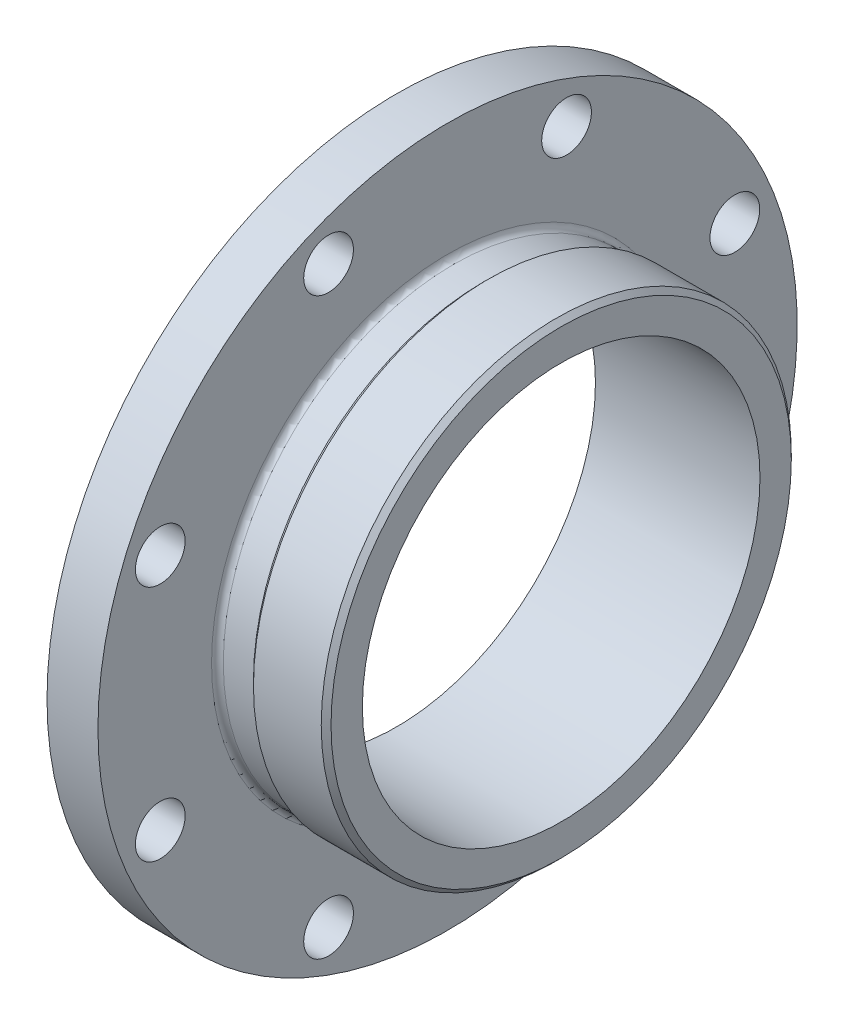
ISO-10303-21;
HEADER;
FILE_DESCRIPTION(('STEP AP214'),'2;1');
FILE_NAME('part.step','',(''),(''),'','','');
FILE_SCHEMA(('AUTOMOTIVE_DESIGN { 1 0 10303 214 1 1 1 1 }'));
ENDSEC;
DATA;
#1=APPLICATION_CONTEXT('core data for automotive mechanical design processes');
#2=APPLICATION_PROTOCOL_DEFINITION('international standard','automotive_design',2000,#1);
#3=PRODUCT_CONTEXT('',#1,'mechanical');
#4=PRODUCT('Part','Part','',(#3));
#5=PRODUCT_RELATED_PRODUCT_CATEGORY('part','',(#4));
#6=PRODUCT_DEFINITION_FORMATION('','',#4);
#7=PRODUCT_DEFINITION_CONTEXT('part definition',#1,'design');
#8=PRODUCT_DEFINITION('design','',#6,#7);
#9=PRODUCT_DEFINITION_SHAPE('','',#8);
#10=(LENGTH_UNIT() NAMED_UNIT(*) SI_UNIT(.MILLI.,.METRE.));
#11=(NAMED_UNIT(*) PLANE_ANGLE_UNIT() SI_UNIT($,.RADIAN.));
#12=(NAMED_UNIT(*) SI_UNIT($,.STERADIAN.) SOLID_ANGLE_UNIT());
#13=UNCERTAINTY_MEASURE_WITH_UNIT(LENGTH_MEASURE(1.E-05),#10,'distance_accuracy_value','');
#14=(GEOMETRIC_REPRESENTATION_CONTEXT(3) GLOBAL_UNCERTAINTY_ASSIGNED_CONTEXT((#13)) GLOBAL_UNIT_ASSIGNED_CONTEXT((#10,
#11,#12)) REPRESENTATION_CONTEXT('',''));
#15=CARTESIAN_POINT('',(0.,0.,0.));
#16=DIRECTION('',(0.,0.,1.));
#17=DIRECTION('',(1.,0.,0.));
#18=AXIS2_PLACEMENT_3D('',#15,#16,#17);
#19=CARTESIAN_POINT('',(0.,101.5,0.));
#20=DIRECTION('',(1.,0.,0.));
#21=DIRECTION('',(0.,0.,-1.));
#22=AXIS2_PLACEMENT_3D('',#19,#20,#21);
#23=PLANE('',#22);
#24=CARTESIAN_POINT('',(0.,146.665875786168,-60.7509948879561));
#25=DIRECTION('',(-1.,0.,0.));
#26=DIRECTION('',(0.,0.707106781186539,0.707106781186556));
#27=AXIS2_PLACEMENT_3D('',#24,#25,#26);
#28=CIRCLE('',#27,12.7);
#29=CARTESIAN_POINT('',(0.,146.665875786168,-48.0509948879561));
#30=VERTEX_POINT('',#29);
#31=EDGE_CURVE('E430',#30,#30,#28,.T.);
#32=ORIENTED_EDGE('',*,*,#31,.F.);
#33=EDGE_LOOP('',(#32));
#34=FACE_BOUND('',#33,.T.);
#35=CARTESIAN_POINT('',(0.,60.7509948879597,-146.665875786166));
#36=DIRECTION('',(-1.,0.,0.));
#37=DIRECTION('',(0.,1.,0.));
#38=AXIS2_PLACEMENT_3D('',#35,#36,#37);
#39=CIRCLE('',#38,12.7);
#40=CARTESIAN_POINT('',(0.,60.7509948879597,-133.965875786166));
#41=VERTEX_POINT('',#40);
#42=EDGE_CURVE('E420',#41,#41,#39,.T.);
#43=ORIENTED_EDGE('',*,*,#42,.F.);
#44=EDGE_LOOP('',(#43));
#45=FACE_BOUND('',#44,.T.);
#46=CARTESIAN_POINT('',(0.,-60.7509948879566,-146.665875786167));
#47=DIRECTION('',(-1.,0.,0.));
#48=DIRECTION('',(0.,0.707106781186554,-0.707106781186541));
#49=AXIS2_PLACEMENT_3D('',#46,#47,#48);
#50=CIRCLE('',#49,12.7);
#51=CARTESIAN_POINT('',(0.,-60.7509948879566,-133.965875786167));
#52=VERTEX_POINT('',#51);
#53=EDGE_CURVE('E417',#52,#52,#50,.T.);
#54=ORIENTED_EDGE('',*,*,#53,.F.);
#55=EDGE_LOOP('',(#54));
#56=FACE_BOUND('',#55,.T.);
#57=CARTESIAN_POINT('',(0.,-146.665875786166,-60.7509948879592));
#58=DIRECTION('',(-1.,0.,0.));
#59=DIRECTION('',(0.,0.,-1.));
#60=AXIS2_PLACEMENT_3D('',#57,#58,#59);
#61=CIRCLE('',#60,12.7);
#62=CARTESIAN_POINT('',(0.,-146.665875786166,-48.0509948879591));
#63=VERTEX_POINT('',#62);
#64=EDGE_CURVE('E414',#63,#63,#61,.T.);
#65=ORIENTED_EDGE('',*,*,#64,.F.);
#66=EDGE_LOOP('',(#65));
#67=FACE_BOUND('',#66,.T.);
#68=CARTESIAN_POINT('',(0.,-146.665875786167,60.7509948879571));
#69=DIRECTION('',(-1.,0.,0.));
#70=DIRECTION('',(0.,-0.707106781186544,-0.707106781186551));
#71=AXIS2_PLACEMENT_3D('',#68,#69,#70);
#72=CIRCLE('',#71,12.7);
#73=CARTESIAN_POINT('',(0.,-146.665875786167,73.4509948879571));
#74=VERTEX_POINT('',#73);
#75=EDGE_CURVE('E410',#74,#74,#72,.T.);
#76=ORIENTED_EDGE('',*,*,#75,.F.);
#77=EDGE_LOOP('',(#76));
#78=FACE_BOUND('',#77,.T.);
#79=CARTESIAN_POINT('',(0.,-60.7509948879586,146.665875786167));
#80=DIRECTION('',(-1.,0.,0.));
#81=DIRECTION('',(0.,-1.,0.));
#82=AXIS2_PLACEMENT_3D('',#79,#80,#81);
#83=CIRCLE('',#82,12.7);
#84=CARTESIAN_POINT('',(0.,-60.7509948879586,159.365875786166));
#85=VERTEX_POINT('',#84);
#86=EDGE_CURVE('E406',#85,#85,#83,.T.);
#87=ORIENTED_EDGE('',*,*,#86,.F.);
#88=EDGE_LOOP('',(#87));
#89=FACE_BOUND('',#88,.T.);
#90=CARTESIAN_POINT('',(0.,60.7509948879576,146.665875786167));
#91=DIRECTION('',(-1.,0.,0.));
#92=DIRECTION('',(0.,-0.707106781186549,0.707106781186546));
#93=AXIS2_PLACEMENT_3D('',#90,#91,#92);
#94=CIRCLE('',#93,12.7);
#95=CARTESIAN_POINT('',(0.,60.7509948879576,159.365875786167));
#96=VERTEX_POINT('',#95);
#97=EDGE_CURVE('E402',#96,#96,#94,.T.);
#98=ORIENTED_EDGE('',*,*,#97,.F.);
#99=EDGE_LOOP('',(#98));
#100=FACE_BOUND('',#99,.T.);
#101=CARTESIAN_POINT('',(0.,146.665875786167,60.7509948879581));
#102=DIRECTION('',(-1.,0.,0.));
#103=DIRECTION('',(0.,0.,1.));
#104=AXIS2_PLACEMENT_3D('',#101,#102,#103);
#105=CIRCLE('',#104,12.7);
#106=CARTESIAN_POINT('',(0.,146.665875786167,73.4509948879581));
#107=VERTEX_POINT('',#106);
#108=EDGE_CURVE('E398',#107,#107,#105,.T.);
#109=ORIENTED_EDGE('',*,*,#108,.F.);
#110=EDGE_LOOP('',(#109));
#111=FACE_BOUND('',#110,.T.);
#112=CARTESIAN_POINT('',(0.,0.,0.));
#113=DIRECTION('',(-1.,0.,0.));
#114=DIRECTION('',(0.,0.,1.));
#115=AXIS2_PLACEMENT_3D('',#112,#113,#114);
#116=CIRCLE('',#115,101.5);
#117=CARTESIAN_POINT('',(0.,0.,101.5));
#118=VERTEX_POINT('',#117);
#119=EDGE_CURVE('E397',#118,#118,#116,.T.);
#120=ORIENTED_EDGE('',*,*,#119,.F.);
#121=EDGE_LOOP('',(#120));
#122=FACE_BOUND('',#121,.T.);
#123=CARTESIAN_POINT('',(0.,0.,0.));
#124=DIRECTION('',(-1.,0.,0.));
#125=DIRECTION('',(0.,0.,1.));
#126=AXIS2_PLACEMENT_3D('',#123,#124,#125);
#127=CIRCLE('',#126,178.5);
#128=CARTESIAN_POINT('',(0.,0.,178.5));
#129=VERTEX_POINT('',#128);
#130=EDGE_CURVE('E390',#129,#129,#127,.T.);
#131=ORIENTED_EDGE('',*,*,#130,.T.);
#132=EDGE_LOOP('',(#131));
#133=FACE_BOUND('',#132,.T.);
#134=ADVANCED_FACE('F378',(#34,#45,#56,#67,#78,#89,#100,#111,#122,#133),#23,.F.);
#135=CARTESIAN_POINT('',(0.,0.,0.));
#136=DIRECTION('',(-1.,0.,0.));
#137=DIRECTION('',(0.,0.,1.));
#138=AXIS2_PLACEMENT_3D('',#135,#136,#137);
#139=CYLINDRICAL_SURFACE('',#138,178.5);
#140=ORIENTED_EDGE('',*,*,#130,.F.);
#141=EDGE_LOOP('',(#140));
#142=FACE_BOUND('',#141,.T.);
#143=CARTESIAN_POINT('',(26.,0.,0.));
#144=DIRECTION('',(-1.,0.,0.));
#145=DIRECTION('',(0.,0.,1.));
#146=AXIS2_PLACEMENT_3D('',#143,#144,#145);
#147=CIRCLE('',#146,178.5);
#148=CARTESIAN_POINT('',(26.,0.,178.5));
#149=VERTEX_POINT('',#148);
#150=EDGE_CURVE('E460',#149,#149,#147,.T.);
#151=ORIENTED_EDGE('',*,*,#150,.T.);
#152=EDGE_LOOP('',(#151));
#153=FACE_BOUND('',#152,.T.);
#154=ADVANCED_FACE('F466',(#142,#153),#139,.T.);
#155=CARTESIAN_POINT('',(26.,178.5,0.));
#156=DIRECTION('',(-1.,0.,0.));
#157=DIRECTION('',(0.,0.,1.));
#158=AXIS2_PLACEMENT_3D('',#155,#156,#157);
#159=PLANE('',#158);
#160=CARTESIAN_POINT('',(26.,146.665875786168,-60.7509948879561));
#161=DIRECTION('',(-1.,0.,0.));
#162=DIRECTION('',(0.,0.,1.));
#163=AXIS2_PLACEMENT_3D('',#160,#161,#162);
#164=CIRCLE('',#163,12.7);
#165=CARTESIAN_POINT('',(26.,146.665875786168,-48.0509948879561));
#166=VERTEX_POINT('',#165);
#167=EDGE_CURVE('E381',#166,#166,#164,.T.);
#168=ORIENTED_EDGE('',*,*,#167,.T.);
#169=EDGE_LOOP('',(#168));
#170=FACE_BOUND('',#169,.T.);
#171=CARTESIAN_POINT('',(26.,60.7509948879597,-146.665875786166));
#172=DIRECTION('',(-1.,0.,0.));
#173=DIRECTION('',(0.,0.,1.));
#174=AXIS2_PLACEMENT_3D('',#171,#172,#173);
#175=CIRCLE('',#174,12.7);
#176=CARTESIAN_POINT('',(26.,60.7509948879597,-133.965875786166));
#177=VERTEX_POINT('',#176);
#178=EDGE_CURVE('E418',#177,#177,#175,.T.);
#179=ORIENTED_EDGE('',*,*,#178,.T.);
#180=EDGE_LOOP('',(#179));
#181=FACE_BOUND('',#180,.T.);
#182=CARTESIAN_POINT('',(26.,-60.7509948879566,-146.665875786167));
#183=DIRECTION('',(-1.,0.,0.));
#184=DIRECTION('',(0.,0.,1.));
#185=AXIS2_PLACEMENT_3D('',#182,#183,#184);
#186=CIRCLE('',#185,12.7);
#187=CARTESIAN_POINT('',(26.,-60.7509948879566,-133.965875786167));
#188=VERTEX_POINT('',#187);
#189=EDGE_CURVE('E415',#188,#188,#186,.T.);
#190=ORIENTED_EDGE('',*,*,#189,.T.);
#191=EDGE_LOOP('',(#190));
#192=FACE_BOUND('',#191,.T.);
#193=CARTESIAN_POINT('',(26.,-146.665875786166,-60.7509948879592));
#194=DIRECTION('',(-1.,0.,0.));
#195=DIRECTION('',(0.,0.,1.));
#196=AXIS2_PLACEMENT_3D('',#193,#194,#195);
#197=CIRCLE('',#196,12.7);
#198=CARTESIAN_POINT('',(26.,-146.665875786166,-48.0509948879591));
#199=VERTEX_POINT('',#198);
#200=EDGE_CURVE('E411',#199,#199,#197,.T.);
#201=ORIENTED_EDGE('',*,*,#200,.T.);
#202=EDGE_LOOP('',(#201));
#203=FACE_BOUND('',#202,.T.);
#204=CARTESIAN_POINT('',(26.,-146.665875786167,60.7509948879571));
#205=DIRECTION('',(-1.,0.,0.));
#206=DIRECTION('',(0.,0.,1.));
#207=AXIS2_PLACEMENT_3D('',#204,#205,#206);
#208=CIRCLE('',#207,12.7);
#209=CARTESIAN_POINT('',(26.,-146.665875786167,73.4509948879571));
#210=VERTEX_POINT('',#209);
#211=EDGE_CURVE('E407',#210,#210,#208,.T.);
#212=ORIENTED_EDGE('',*,*,#211,.T.);
#213=EDGE_LOOP('',(#212));
#214=FACE_BOUND('',#213,.T.);
#215=CARTESIAN_POINT('',(26.,-60.7509948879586,146.665875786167));
#216=DIRECTION('',(-1.,0.,0.));
#217=DIRECTION('',(0.,0.,1.));
#218=AXIS2_PLACEMENT_3D('',#215,#216,#217);
#219=CIRCLE('',#218,12.7);
#220=CARTESIAN_POINT('',(26.,-60.7509948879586,159.365875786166));
#221=VERTEX_POINT('',#220);
#222=EDGE_CURVE('E403',#221,#221,#219,.T.);
#223=ORIENTED_EDGE('',*,*,#222,.T.);
#224=EDGE_LOOP('',(#223));
#225=FACE_BOUND('',#224,.T.);
#226=CARTESIAN_POINT('',(26.,60.7509948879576,146.665875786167));
#227=DIRECTION('',(-1.,0.,0.));
#228=DIRECTION('',(0.,0.,1.));
#229=AXIS2_PLACEMENT_3D('',#226,#227,#228);
#230=CIRCLE('',#229,12.7);
#231=CARTESIAN_POINT('',(26.,60.7509948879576,159.365875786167));
#232=VERTEX_POINT('',#231);
#233=EDGE_CURVE('E399',#232,#232,#230,.T.);
#234=ORIENTED_EDGE('',*,*,#233,.T.);
#235=EDGE_LOOP('',(#234));
#236=FACE_BOUND('',#235,.T.);
#237=CARTESIAN_POINT('',(26.,146.665875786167,60.7509948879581));
#238=DIRECTION('',(-1.,0.,0.));
#239=DIRECTION('',(0.,0.,1.));
#240=AXIS2_PLACEMENT_3D('',#237,#238,#239);
#241=CIRCLE('',#240,12.7);
#242=CARTESIAN_POINT('',(26.,146.665875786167,73.4509948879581));
#243=VERTEX_POINT('',#242);
#244=EDGE_CURVE('E394',#243,#243,#241,.T.);
#245=ORIENTED_EDGE('',*,*,#244,.T.);
#246=EDGE_LOOP('',(#245));
#247=FACE_BOUND('',#246,.T.);
#248=CARTESIAN_POINT('',(26.,0.,0.));
#249=DIRECTION('',(-1.,0.,0.));
#250=DIRECTION('',(0.,0.,1.));
#251=AXIS2_PLACEMENT_3D('',#248,#249,#250);
#252=CIRCLE('',#251,120.5);
#253=CARTESIAN_POINT('',(26.,0.,120.5));
#254=VERTEX_POINT('',#253);
#255=EDGE_CURVE('E385',#254,#254,#252,.T.);
#256=ORIENTED_EDGE('',*,*,#255,.T.);
#257=EDGE_LOOP('',(#256));
#258=FACE_BOUND('',#257,.T.);
#259=ORIENTED_EDGE('',*,*,#150,.F.);
#260=EDGE_LOOP('',(#259));
#261=FACE_BOUND('',#260,.T.);
#262=ADVANCED_FACE('F469',(#170,#181,#192,#203,#214,#225,#236,#247,#258,#261),#159,.F.);
#263=CARTESIAN_POINT('',(0.,0.,0.));
#264=DIRECTION('',(-1.,0.,0.));
#265=DIRECTION('',(0.,0.,1.));
#266=AXIS2_PLACEMENT_3D('',#263,#264,#265);
#267=CYLINDRICAL_SURFACE('',#266,117.5);
#268=CARTESIAN_POINT('',(29.,0.,0.));
#269=DIRECTION('',(-1.,0.,0.));
#270=DIRECTION('',(0.,0.,1.));
#271=AXIS2_PLACEMENT_3D('',#268,#269,#270);
#272=CIRCLE('',#271,117.5);
#273=CARTESIAN_POINT('',(29.,0.,117.5));
#274=VERTEX_POINT('',#273);
#275=EDGE_CURVE('E10',#274,#274,#272,.F.);
#276=ORIENTED_EDGE('',*,*,#275,.T.);
#277=EDGE_LOOP('',(#276));
#278=FACE_BOUND('',#277,.T.);
#279=CARTESIAN_POINT('',(44.4,0.,0.));
#280=DIRECTION('',(-1.,0.,0.));
#281=DIRECTION('',(0.,0.,1.));
#282=AXIS2_PLACEMENT_3D('',#279,#280,#281);
#283=CIRCLE('',#282,117.5);
#284=CARTESIAN_POINT('',(44.4,0.,117.5));
#285=VERTEX_POINT('',#284);
#286=EDGE_CURVE('E457',#285,#285,#283,.T.);
#287=ORIENTED_EDGE('',*,*,#286,.T.);
#288=EDGE_LOOP('',(#287));
#289=FACE_BOUND('',#288,.T.);
#290=ADVANCED_FACE('F473',(#278,#289),#267,.T.);
#291=CARTESIAN_POINT('',(46.9,0.,0.));
#292=DIRECTION('',(1.,0.,0.));
#293=DIRECTION('',(0.,0.,-1.));
#294=AXIS2_PLACEMENT_3D('',#291,#292,#293);
#295=CONICAL_SURFACE('',#294,120.,0.785398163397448);
#296=ORIENTED_EDGE('',*,*,#286,.F.);
#297=EDGE_LOOP('',(#296));
#298=FACE_BOUND('',#297,.T.);
#299=CARTESIAN_POINT('',(46.9,0.,0.));
#300=DIRECTION('',(-1.,0.,0.));
#301=DIRECTION('',(0.,0.,1.));
#302=AXIS2_PLACEMENT_3D('',#299,#300,#301);
#303=CIRCLE('',#302,120.);
#304=CARTESIAN_POINT('',(46.9,0.,120.));
#305=VERTEX_POINT('',#304);
#306=EDGE_CURVE('E454',#305,#305,#303,.T.);
#307=ORIENTED_EDGE('',*,*,#306,.T.);
#308=EDGE_LOOP('',(#307));
#309=FACE_BOUND('',#308,.T.);
#310=ADVANCED_FACE('F481',(#298,#309),#295,.T.);
#311=CARTESIAN_POINT('',(0.,0.,0.));
#312=DIRECTION('',(-1.,0.,0.));
#313=DIRECTION('',(0.,0.,1.));
#314=AXIS2_PLACEMENT_3D('',#311,#312,#313);
#315=CYLINDRICAL_SURFACE('',#314,120.);
#316=ORIENTED_EDGE('',*,*,#306,.F.);
#317=EDGE_LOOP('',(#316));
#318=FACE_BOUND('',#317,.T.);
#319=CARTESIAN_POINT('',(81.5,0.,0.));
#320=DIRECTION('',(-1.,0.,0.));
#321=DIRECTION('',(0.,0.,1.));
#322=AXIS2_PLACEMENT_3D('',#319,#320,#321);
#323=CIRCLE('',#322,120.);
#324=CARTESIAN_POINT('',(81.5,0.,120.));
#325=VERTEX_POINT('',#324);
#326=EDGE_CURVE('E451',#325,#325,#323,.T.);
#327=ORIENTED_EDGE('',*,*,#326,.T.);
#328=EDGE_LOOP('',(#327));
#329=FACE_BOUND('',#328,.T.);
#330=ADVANCED_FACE('F526',(#318,#329),#315,.T.);
#331=CARTESIAN_POINT('',(84.,0.,0.));
#332=DIRECTION('',(-1.,0.,0.));
#333=DIRECTION('',(0.,0.,1.));
#334=AXIS2_PLACEMENT_3D('',#331,#332,#333);
#335=CONICAL_SURFACE('',#334,117.5,0.785398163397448);
#336=ORIENTED_EDGE('',*,*,#326,.F.);
#337=EDGE_LOOP('',(#336));
#338=FACE_BOUND('',#337,.T.);
#339=CARTESIAN_POINT('',(84.,0.,0.));
#340=DIRECTION('',(-1.,0.,0.));
#341=DIRECTION('',(0.,0.,1.));
#342=AXIS2_PLACEMENT_3D('',#339,#340,#341);
#343=CIRCLE('',#342,117.5);
#344=CARTESIAN_POINT('',(84.,0.,117.5));
#345=VERTEX_POINT('',#344);
#346=EDGE_CURVE('E448',#345,#345,#343,.T.);
#347=ORIENTED_EDGE('',*,*,#346,.T.);
#348=EDGE_LOOP('',(#347));
#349=FACE_BOUND('',#348,.T.);
#350=ADVANCED_FACE('F518',(#338,#349),#335,.T.);
#351=CARTESIAN_POINT('',(84.,101.5,0.));
#352=DIRECTION('',(-1.,0.,0.));
#353=DIRECTION('',(0.,0.,1.));
#354=AXIS2_PLACEMENT_3D('',#351,#352,#353);
#355=PLANE('',#354);
#356=ORIENTED_EDGE('',*,*,#346,.F.);
#357=EDGE_LOOP('',(#356));
#358=FACE_BOUND('',#357,.T.);
#359=CARTESIAN_POINT('',(84.,0.,0.));
#360=DIRECTION('',(-1.,0.,0.));
#361=DIRECTION('',(0.,0.,1.));
#362=AXIS2_PLACEMENT_3D('',#359,#360,#361);
#363=CIRCLE('',#362,101.5);
#364=CARTESIAN_POINT('',(84.,0.,101.5));
#365=VERTEX_POINT('',#364);
#366=EDGE_CURVE('E445',#365,#365,#363,.T.);
#367=ORIENTED_EDGE('',*,*,#366,.T.);
#368=EDGE_LOOP('',(#367));
#369=FACE_BOUND('',#368,.T.);
#370=ADVANCED_FACE('F508',(#358,#369),#355,.F.);
#371=CARTESIAN_POINT('',(0.,0.,0.));
#372=DIRECTION('',(-1.,0.,0.));
#373=DIRECTION('',(0.,0.,1.));
#374=AXIS2_PLACEMENT_3D('',#371,#372,#373);
#375=CYLINDRICAL_SURFACE('',#374,101.5);
#376=ORIENTED_EDGE('',*,*,#366,.F.);
#377=EDGE_LOOP('',(#376));
#378=FACE_BOUND('',#377,.T.);
#379=ORIENTED_EDGE('',*,*,#119,.T.);
#380=EDGE_LOOP('',(#379));
#381=FACE_BOUND('',#380,.T.);
#382=ADVANCED_FACE('F505',(#378,#381),#375,.F.);
#383=CARTESIAN_POINT('',(29.,0.,0.));
#384=DIRECTION('',(-1.,0.,0.));
#385=DIRECTION('',(0.,0.,1.));
#386=AXIS2_PLACEMENT_3D('',#383,#384,#385);
#387=TOROIDAL_SURFACE('',#386,120.5,3.);
#388=ORIENTED_EDGE('',*,*,#275,.F.);
#389=EDGE_LOOP('',(#388));
#390=FACE_BOUND('',#389,.T.);
#391=ORIENTED_EDGE('',*,*,#255,.F.);
#392=EDGE_LOOP('',(#391));
#393=FACE_BOUND('',#392,.T.);
#394=ADVANCED_FACE('F507',(#390,#393),#387,.F.);
#395=CARTESIAN_POINT('',(84.,146.665875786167,60.7509948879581));
#396=DIRECTION('',(-1.,0.,0.));
#397=DIRECTION('',(0.,0.,1.));
#398=AXIS2_PLACEMENT_3D('',#395,#396,#397);
#399=CYLINDRICAL_SURFACE('',#398,12.7);
#400=CARTESIAN_POINT('',(0.,146.665875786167,73.4509948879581));
#401=CARTESIAN_POINT('',(0.270833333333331,146.665875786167,73.4509948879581));
#402=CARTESIAN_POINT('',(0.541666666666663,146.665875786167,73.4509948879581));
#403=CARTESIAN_POINT('',(1.08333333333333,146.665875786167,73.4509948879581));
#404=CARTESIAN_POINT('',(1.35416666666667,146.665875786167,73.4509948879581));
#405=CARTESIAN_POINT('',(1.89583333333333,146.665875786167,73.4509948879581));
#406=CARTESIAN_POINT('',(2.16666666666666,146.665875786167,73.4509948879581));
#407=CARTESIAN_POINT('',(2.70833333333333,146.665875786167,73.4509948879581));
#408=CARTESIAN_POINT('',(2.97916666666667,146.665875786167,73.4509948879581));
#409=CARTESIAN_POINT('',(3.52083333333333,146.665875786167,73.4509948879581));
#410=CARTESIAN_POINT('',(3.79166666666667,146.665875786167,73.4509948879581));
#411=CARTESIAN_POINT('',(4.33333333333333,146.665875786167,73.4509948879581));
#412=CARTESIAN_POINT('',(4.60416666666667,146.665875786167,73.4509948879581));
#413=CARTESIAN_POINT('',(5.14583333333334,146.665875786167,73.4509948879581));
#414=CARTESIAN_POINT('',(5.41666666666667,146.665875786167,73.4509948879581));
#415=CARTESIAN_POINT('',(5.95833333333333,146.665875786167,73.4509948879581));
#416=CARTESIAN_POINT('',(6.22916666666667,146.665875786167,73.4509948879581));
#417=CARTESIAN_POINT('',(6.77083333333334,146.665875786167,73.4509948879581));
#418=CARTESIAN_POINT('',(7.04166666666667,146.665875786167,73.4509948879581));
#419=CARTESIAN_POINT('',(7.58333333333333,146.665875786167,73.4509948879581));
#420=CARTESIAN_POINT('',(7.85416666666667,146.665875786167,73.4509948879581));
#421=CARTESIAN_POINT('',(8.39583333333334,146.665875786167,73.4509948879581));
#422=CARTESIAN_POINT('',(8.66666666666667,146.665875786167,73.4509948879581));
#423=CARTESIAN_POINT('',(9.20833333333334,146.665875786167,73.4509948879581));
#424=CARTESIAN_POINT('',(9.47916666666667,146.665875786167,73.4509948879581));
#425=CARTESIAN_POINT('',(10.0208333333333,146.665875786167,73.4509948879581));
#426=CARTESIAN_POINT('',(10.2916666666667,146.665875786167,73.4509948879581));
#427=CARTESIAN_POINT('',(10.8333333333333,146.665875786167,73.4509948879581));
#428=CARTESIAN_POINT('',(11.1041666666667,146.665875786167,73.4509948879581));
#429=CARTESIAN_POINT('',(11.6458333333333,146.665875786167,73.4509948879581));
#430=CARTESIAN_POINT('',(11.9166666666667,146.665875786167,73.4509948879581));
#431=CARTESIAN_POINT('',(12.4583333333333,146.665875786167,73.4509948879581));
#432=CARTESIAN_POINT('',(12.7291666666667,146.665875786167,73.4509948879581));
#433=CARTESIAN_POINT('',(13.2708333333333,146.665875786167,73.4509948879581));
#434=CARTESIAN_POINT('',(13.5416666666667,146.665875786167,73.4509948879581));
#435=CARTESIAN_POINT('',(14.0833333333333,146.665875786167,73.4509948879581));
#436=CARTESIAN_POINT('',(14.3541666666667,146.665875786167,73.4509948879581));
#437=CARTESIAN_POINT('',(14.8958333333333,146.665875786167,73.4509948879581));
#438=CARTESIAN_POINT('',(15.1666666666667,146.665875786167,73.4509948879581));
#439=CARTESIAN_POINT('',(15.7083333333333,146.665875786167,73.4509948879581));
#440=CARTESIAN_POINT('',(15.9791666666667,146.665875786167,73.4509948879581));
#441=CARTESIAN_POINT('',(16.5208333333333,146.665875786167,73.4509948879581));
#442=CARTESIAN_POINT('',(16.7916666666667,146.665875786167,73.4509948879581));
#443=CARTESIAN_POINT('',(17.3333333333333,146.665875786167,73.4509948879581));
#444=CARTESIAN_POINT('',(17.6041666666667,146.665875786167,73.4509948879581));
#445=CARTESIAN_POINT('',(18.1458333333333,146.665875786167,73.4509948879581));
#446=CARTESIAN_POINT('',(18.4166666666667,146.665875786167,73.4509948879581));
#447=CARTESIAN_POINT('',(18.9583333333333,146.665875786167,73.4509948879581));
#448=CARTESIAN_POINT('',(19.2291666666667,146.665875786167,73.4509948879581));
#449=CARTESIAN_POINT('',(19.7708333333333,146.665875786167,73.4509948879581));
#450=CARTESIAN_POINT('',(20.0416666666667,146.665875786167,73.4509948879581));
#451=CARTESIAN_POINT('',(20.5833333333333,146.665875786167,73.4509948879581));
#452=CARTESIAN_POINT('',(20.8541666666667,146.665875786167,73.4509948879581));
#453=CARTESIAN_POINT('',(21.3958333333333,146.665875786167,73.4509948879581));
#454=CARTESIAN_POINT('',(21.6666666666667,146.665875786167,73.4509948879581));
#455=CARTESIAN_POINT('',(22.2083333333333,146.665875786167,73.4509948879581));
#456=CARTESIAN_POINT('',(22.4791666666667,146.665875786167,73.4509948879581));
#457=CARTESIAN_POINT('',(23.0208333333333,146.665875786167,73.4509948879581));
#458=CARTESIAN_POINT('',(23.2916666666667,146.665875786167,73.4509948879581));
#459=CARTESIAN_POINT('',(23.8333333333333,146.665875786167,73.4509948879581));
#460=CARTESIAN_POINT('',(24.1041666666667,146.665875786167,73.4509948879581));
#461=CARTESIAN_POINT('',(24.6458333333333,146.665875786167,73.4509948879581));
#462=CARTESIAN_POINT('',(24.9166666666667,146.665875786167,73.4509948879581));
#463=CARTESIAN_POINT('',(25.4583333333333,146.665875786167,73.4509948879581));
#464=CARTESIAN_POINT('',(25.7291666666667,146.665875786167,73.4509948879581));
#465=CARTESIAN_POINT('',(26.,146.665875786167,73.4509948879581));
#466=B_SPLINE_CURVE_WITH_KNOTS('',3,(#400,#401,#402,#403,#404,#405,#406,#407,#408,#409,#410,
#411,#412,#413,#414,#415,#416,#417,#418,#419,#420,#421,#422,#423,#424,#425,#426,#427,#428,#429,
#430,#431,#432,#433,#434,#435,#436,#437,#438,#439,#440,#441,#442,#443,#444,#445,#446,#447,#448,
#449,#450,#451,#452,#453,#454,#455,#456,#457,#458,#459,#460,#461,#462,#463,#464,#465),
.UNSPECIFIED.,.F.,.F.,(4,2,2,2,2,2,2,2,2,2,2,2,2,2,2,2,2,2,2,2,2,2,2,2,2,2,2,2,2,2,2,2,4),(0.,
0.812499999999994,1.625,2.4375,3.25,4.0625,4.875,5.6875,6.50000000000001,7.3125,
8.12500000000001,8.9375,9.75000000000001,10.5625,11.375,12.1875,13.,13.8125,14.625,15.4375,
16.25,17.0625,17.875,18.6875,19.5,20.3125,21.125,21.9375,22.75,23.5625,24.375,25.1875,26.),.UNSPECIFIED.);
#467=EDGE_CURVE('BSEAM515',#107,#243,#466,.T.);
#468=ORIENTED_EDGE('',*,*,#108,.T.);
#469=ORIENTED_EDGE('',*,*,#244,.F.);
#470=ORIENTED_EDGE('',*,*,#467,.T.);
#471=ORIENTED_EDGE('',*,*,#467,.F.);
#472=EDGE_LOOP('',(#468,#470,#469,#471));
#473=FACE_BOUND('',#472,.T.);
#474=ADVANCED_FACE('F515',(#473),#399,.F.);
#475=CARTESIAN_POINT('',(84.,60.7509948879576,146.665875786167));
#476=DIRECTION('',(-1.,0.,0.));
#477=DIRECTION('',(0.,0.,1.));
#478=AXIS2_PLACEMENT_3D('',#475,#476,#477);
#479=CYLINDRICAL_SURFACE('',#478,12.7);
#480=CARTESIAN_POINT('',(0.,60.7509948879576,159.365875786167));
#481=CARTESIAN_POINT('',(0.270833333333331,60.7509948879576,159.365875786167));
#482=CARTESIAN_POINT('',(0.541666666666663,60.7509948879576,159.365875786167));
#483=CARTESIAN_POINT('',(1.08333333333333,60.7509948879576,159.365875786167));
#484=CARTESIAN_POINT('',(1.35416666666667,60.7509948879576,159.365875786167));
#485=CARTESIAN_POINT('',(1.89583333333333,60.7509948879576,159.365875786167));
#486=CARTESIAN_POINT('',(2.16666666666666,60.7509948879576,159.365875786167));
#487=CARTESIAN_POINT('',(2.70833333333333,60.7509948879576,159.365875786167));
#488=CARTESIAN_POINT('',(2.97916666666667,60.7509948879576,159.365875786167));
#489=CARTESIAN_POINT('',(3.52083333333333,60.7509948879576,159.365875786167));
#490=CARTESIAN_POINT('',(3.79166666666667,60.7509948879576,159.365875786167));
#491=CARTESIAN_POINT('',(4.33333333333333,60.7509948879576,159.365875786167));
#492=CARTESIAN_POINT('',(4.60416666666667,60.7509948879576,159.365875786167));
#493=CARTESIAN_POINT('',(5.14583333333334,60.7509948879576,159.365875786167));
#494=CARTESIAN_POINT('',(5.41666666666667,60.7509948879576,159.365875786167));
#495=CARTESIAN_POINT('',(5.95833333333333,60.7509948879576,159.365875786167));
#496=CARTESIAN_POINT('',(6.22916666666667,60.7509948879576,159.365875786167));
#497=CARTESIAN_POINT('',(6.77083333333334,60.7509948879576,159.365875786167));
#498=CARTESIAN_POINT('',(7.04166666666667,60.7509948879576,159.365875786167));
#499=CARTESIAN_POINT('',(7.58333333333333,60.7509948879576,159.365875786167));
#500=CARTESIAN_POINT('',(7.85416666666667,60.7509948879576,159.365875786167));
#501=CARTESIAN_POINT('',(8.39583333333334,60.7509948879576,159.365875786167));
#502=CARTESIAN_POINT('',(8.66666666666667,60.7509948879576,159.365875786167));
#503=CARTESIAN_POINT('',(9.20833333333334,60.7509948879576,159.365875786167));
#504=CARTESIAN_POINT('',(9.47916666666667,60.7509948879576,159.365875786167));
#505=CARTESIAN_POINT('',(10.0208333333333,60.7509948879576,159.365875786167));
#506=CARTESIAN_POINT('',(10.2916666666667,60.7509948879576,159.365875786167));
#507=CARTESIAN_POINT('',(10.8333333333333,60.7509948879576,159.365875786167));
#508=CARTESIAN_POINT('',(11.1041666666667,60.7509948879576,159.365875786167));
#509=CARTESIAN_POINT('',(11.6458333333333,60.7509948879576,159.365875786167));
#510=CARTESIAN_POINT('',(11.9166666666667,60.7509948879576,159.365875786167));
#511=CARTESIAN_POINT('',(12.4583333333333,60.7509948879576,159.365875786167));
#512=CARTESIAN_POINT('',(12.7291666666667,60.7509948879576,159.365875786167));
#513=CARTESIAN_POINT('',(13.2708333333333,60.7509948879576,159.365875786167));
#514=CARTESIAN_POINT('',(13.5416666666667,60.7509948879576,159.365875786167));
#515=CARTESIAN_POINT('',(14.0833333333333,60.7509948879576,159.365875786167));
#516=CARTESIAN_POINT('',(14.3541666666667,60.7509948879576,159.365875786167));
#517=CARTESIAN_POINT('',(14.8958333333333,60.7509948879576,159.365875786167));
#518=CARTESIAN_POINT('',(15.1666666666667,60.7509948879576,159.365875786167));
#519=CARTESIAN_POINT('',(15.7083333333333,60.7509948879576,159.365875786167));
#520=CARTESIAN_POINT('',(15.9791666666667,60.7509948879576,159.365875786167));
#521=CARTESIAN_POINT('',(16.5208333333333,60.7509948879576,159.365875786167));
#522=CARTESIAN_POINT('',(16.7916666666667,60.7509948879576,159.365875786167));
#523=CARTESIAN_POINT('',(17.3333333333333,60.7509948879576,159.365875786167));
#524=CARTESIAN_POINT('',(17.6041666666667,60.7509948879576,159.365875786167));
#525=CARTESIAN_POINT('',(18.1458333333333,60.7509948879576,159.365875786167));
#526=CARTESIAN_POINT('',(18.4166666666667,60.7509948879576,159.365875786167));
#527=CARTESIAN_POINT('',(18.9583333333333,60.7509948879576,159.365875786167));
#528=CARTESIAN_POINT('',(19.2291666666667,60.7509948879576,159.365875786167));
#529=CARTESIAN_POINT('',(19.7708333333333,60.7509948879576,159.365875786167));
#530=CARTESIAN_POINT('',(20.0416666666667,60.7509948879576,159.365875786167));
#531=CARTESIAN_POINT('',(20.5833333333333,60.7509948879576,159.365875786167));
#532=CARTESIAN_POINT('',(20.8541666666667,60.7509948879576,159.365875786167));
#533=CARTESIAN_POINT('',(21.3958333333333,60.7509948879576,159.365875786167));
#534=CARTESIAN_POINT('',(21.6666666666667,60.7509948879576,159.365875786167));
#535=CARTESIAN_POINT('',(22.2083333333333,60.7509948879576,159.365875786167));
#536=CARTESIAN_POINT('',(22.4791666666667,60.7509948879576,159.365875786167));
#537=CARTESIAN_POINT('',(23.0208333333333,60.7509948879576,159.365875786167));
#538=CARTESIAN_POINT('',(23.2916666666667,60.7509948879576,159.365875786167));
#539=CARTESIAN_POINT('',(23.8333333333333,60.7509948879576,159.365875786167));
#540=CARTESIAN_POINT('',(24.1041666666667,60.7509948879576,159.365875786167));
#541=CARTESIAN_POINT('',(24.6458333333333,60.7509948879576,159.365875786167));
#542=CARTESIAN_POINT('',(24.9166666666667,60.7509948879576,159.365875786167));
#543=CARTESIAN_POINT('',(25.4583333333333,60.7509948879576,159.365875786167));
#544=CARTESIAN_POINT('',(25.7291666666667,60.7509948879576,159.365875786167));
#545=CARTESIAN_POINT('',(26.,60.7509948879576,159.365875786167));
#546=B_SPLINE_CURVE_WITH_KNOTS('',3,(#480,#481,#482,#483,#484,#485,#486,#487,#488,#489,#490,
#491,#492,#493,#494,#495,#496,#497,#498,#499,#500,#501,#502,#503,#504,#505,#506,#507,#508,#509,
#510,#511,#512,#513,#514,#515,#516,#517,#518,#519,#520,#521,#522,#523,#524,#525,#526,#527,#528,
#529,#530,#531,#532,#533,#534,#535,#536,#537,#538,#539,#540,#541,#542,#543,#544,#545),
.UNSPECIFIED.,.F.,.F.,(4,2,2,2,2,2,2,2,2,2,2,2,2,2,2,2,2,2,2,2,2,2,2,2,2,2,2,2,2,2,2,2,4),(0.,
0.812499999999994,1.625,2.4375,3.25,4.0625,4.875,5.6875,6.50000000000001,7.3125,
8.12500000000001,8.9375,9.75000000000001,10.5625,11.375,12.1875,13.,13.8125,14.625,15.4375,
16.25,17.0625,17.875,18.6875,19.5,20.3125,21.125,21.9375,22.75,23.5625,24.375,25.1875,26.),.UNSPECIFIED.);
#547=EDGE_CURVE('BSEAM571',#96,#232,#546,.T.);
#548=ORIENTED_EDGE('',*,*,#97,.T.);
#549=ORIENTED_EDGE('',*,*,#233,.F.);
#550=ORIENTED_EDGE('',*,*,#547,.T.);
#551=ORIENTED_EDGE('',*,*,#547,.F.);
#552=EDGE_LOOP('',(#548,#550,#549,#551));
#553=FACE_BOUND('',#552,.T.);
#554=ADVANCED_FACE('F571',(#553),#479,.F.);
#555=CARTESIAN_POINT('',(84.,-60.7509948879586,146.665875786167));
#556=DIRECTION('',(-1.,0.,0.));
#557=DIRECTION('',(0.,0.,1.));
#558=AXIS2_PLACEMENT_3D('',#555,#556,#557);
#559=CYLINDRICAL_SURFACE('',#558,12.7);
#560=CARTESIAN_POINT('',(0.,-60.7509948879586,159.365875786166));
#561=CARTESIAN_POINT('',(0.270833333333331,-60.7509948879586,159.365875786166));
#562=CARTESIAN_POINT('',(0.541666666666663,-60.7509948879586,159.365875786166));
#563=CARTESIAN_POINT('',(1.08333333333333,-60.7509948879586,159.365875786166));
#564=CARTESIAN_POINT('',(1.35416666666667,-60.7509948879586,159.365875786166));
#565=CARTESIAN_POINT('',(1.89583333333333,-60.7509948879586,159.365875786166));
#566=CARTESIAN_POINT('',(2.16666666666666,-60.7509948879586,159.365875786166));
#567=CARTESIAN_POINT('',(2.70833333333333,-60.7509948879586,159.365875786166));
#568=CARTESIAN_POINT('',(2.97916666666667,-60.7509948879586,159.365875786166));
#569=CARTESIAN_POINT('',(3.52083333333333,-60.7509948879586,159.365875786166));
#570=CARTESIAN_POINT('',(3.79166666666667,-60.7509948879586,159.365875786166));
#571=CARTESIAN_POINT('',(4.33333333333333,-60.7509948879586,159.365875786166));
#572=CARTESIAN_POINT('',(4.60416666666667,-60.7509948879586,159.365875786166));
#573=CARTESIAN_POINT('',(5.14583333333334,-60.7509948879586,159.365875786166));
#574=CARTESIAN_POINT('',(5.41666666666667,-60.7509948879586,159.365875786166));
#575=CARTESIAN_POINT('',(5.95833333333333,-60.7509948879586,159.365875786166));
#576=CARTESIAN_POINT('',(6.22916666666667,-60.7509948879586,159.365875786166));
#577=CARTESIAN_POINT('',(6.77083333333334,-60.7509948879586,159.365875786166));
#578=CARTESIAN_POINT('',(7.04166666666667,-60.7509948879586,159.365875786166));
#579=CARTESIAN_POINT('',(7.58333333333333,-60.7509948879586,159.365875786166));
#580=CARTESIAN_POINT('',(7.85416666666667,-60.7509948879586,159.365875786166));
#581=CARTESIAN_POINT('',(8.39583333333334,-60.7509948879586,159.365875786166));
#582=CARTESIAN_POINT('',(8.66666666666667,-60.7509948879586,159.365875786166));
#583=CARTESIAN_POINT('',(9.20833333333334,-60.7509948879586,159.365875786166));
#584=CARTESIAN_POINT('',(9.47916666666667,-60.7509948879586,159.365875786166));
#585=CARTESIAN_POINT('',(10.0208333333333,-60.7509948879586,159.365875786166));
#586=CARTESIAN_POINT('',(10.2916666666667,-60.7509948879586,159.365875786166));
#587=CARTESIAN_POINT('',(10.8333333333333,-60.7509948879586,159.365875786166));
#588=CARTESIAN_POINT('',(11.1041666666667,-60.7509948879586,159.365875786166));
#589=CARTESIAN_POINT('',(11.6458333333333,-60.7509948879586,159.365875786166));
#590=CARTESIAN_POINT('',(11.9166666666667,-60.7509948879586,159.365875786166));
#591=CARTESIAN_POINT('',(12.4583333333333,-60.7509948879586,159.365875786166));
#592=CARTESIAN_POINT('',(12.7291666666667,-60.7509948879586,159.365875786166));
#593=CARTESIAN_POINT('',(13.2708333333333,-60.7509948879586,159.365875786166));
#594=CARTESIAN_POINT('',(13.5416666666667,-60.7509948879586,159.365875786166));
#595=CARTESIAN_POINT('',(14.0833333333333,-60.7509948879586,159.365875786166));
#596=CARTESIAN_POINT('',(14.3541666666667,-60.7509948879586,159.365875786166));
#597=CARTESIAN_POINT('',(14.8958333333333,-60.7509948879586,159.365875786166));
#598=CARTESIAN_POINT('',(15.1666666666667,-60.7509948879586,159.365875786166));
#599=CARTESIAN_POINT('',(15.7083333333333,-60.7509948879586,159.365875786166));
#600=CARTESIAN_POINT('',(15.9791666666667,-60.7509948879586,159.365875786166));
#601=CARTESIAN_POINT('',(16.5208333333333,-60.7509948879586,159.365875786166));
#602=CARTESIAN_POINT('',(16.7916666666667,-60.7509948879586,159.365875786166));
#603=CARTESIAN_POINT('',(17.3333333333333,-60.7509948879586,159.365875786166));
#604=CARTESIAN_POINT('',(17.6041666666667,-60.7509948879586,159.365875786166));
#605=CARTESIAN_POINT('',(18.1458333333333,-60.7509948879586,159.365875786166));
#606=CARTESIAN_POINT('',(18.4166666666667,-60.7509948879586,159.365875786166));
#607=CARTESIAN_POINT('',(18.9583333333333,-60.7509948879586,159.365875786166));
#608=CARTESIAN_POINT('',(19.2291666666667,-60.7509948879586,159.365875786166));
#609=CARTESIAN_POINT('',(19.7708333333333,-60.7509948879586,159.365875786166));
#610=CARTESIAN_POINT('',(20.0416666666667,-60.7509948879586,159.365875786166));
#611=CARTESIAN_POINT('',(20.5833333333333,-60.7509948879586,159.365875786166));
#612=CARTESIAN_POINT('',(20.8541666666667,-60.7509948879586,159.365875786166));
#613=CARTESIAN_POINT('',(21.3958333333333,-60.7509948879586,159.365875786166));
#614=CARTESIAN_POINT('',(21.6666666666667,-60.7509948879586,159.365875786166));
#615=CARTESIAN_POINT('',(22.2083333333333,-60.7509948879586,159.365875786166));
#616=CARTESIAN_POINT('',(22.4791666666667,-60.7509948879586,159.365875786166));
#617=CARTESIAN_POINT('',(23.0208333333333,-60.7509948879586,159.365875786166));
#618=CARTESIAN_POINT('',(23.2916666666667,-60.7509948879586,159.365875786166));
#619=CARTESIAN_POINT('',(23.8333333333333,-60.7509948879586,159.365875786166));
#620=CARTESIAN_POINT('',(24.1041666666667,-60.7509948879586,159.365875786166));
#621=CARTESIAN_POINT('',(24.6458333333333,-60.7509948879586,159.365875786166));
#622=CARTESIAN_POINT('',(24.9166666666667,-60.7509948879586,159.365875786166));
#623=CARTESIAN_POINT('',(25.4583333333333,-60.7509948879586,159.365875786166));
#624=CARTESIAN_POINT('',(25.7291666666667,-60.7509948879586,159.365875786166));
#625=CARTESIAN_POINT('',(26.,-60.7509948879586,159.365875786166));
#626=B_SPLINE_CURVE_WITH_KNOTS('',3,(#560,#561,#562,#563,#564,#565,#566,#567,#568,#569,#570,
#571,#572,#573,#574,#575,#576,#577,#578,#579,#580,#581,#582,#583,#584,#585,#586,#587,#588,#589,
#590,#591,#592,#593,#594,#595,#596,#597,#598,#599,#600,#601,#602,#603,#604,#605,#606,#607,#608,
#609,#610,#611,#612,#613,#614,#615,#616,#617,#618,#619,#620,#621,#622,#623,#624,#625),
.UNSPECIFIED.,.F.,.F.,(4,2,2,2,2,2,2,2,2,2,2,2,2,2,2,2,2,2,2,2,2,2,2,2,2,2,2,2,2,2,2,2,4),(0.,
0.812499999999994,1.625,2.4375,3.25,4.0625,4.875,5.6875,6.50000000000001,7.3125,
8.12500000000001,8.9375,9.75000000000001,10.5625,11.375,12.1875,13.,13.8125,14.625,15.4375,
16.25,17.0625,17.875,18.6875,19.5,20.3125,21.125,21.9375,22.75,23.5625,24.375,25.1875,26.),.UNSPECIFIED.);
#627=EDGE_CURVE('BSEAM577',#85,#221,#626,.T.);
#628=ORIENTED_EDGE('',*,*,#86,.T.);
#629=ORIENTED_EDGE('',*,*,#222,.F.);
#630=ORIENTED_EDGE('',*,*,#627,.T.);
#631=ORIENTED_EDGE('',*,*,#627,.F.);
#632=EDGE_LOOP('',(#628,#630,#629,#631));
#633=FACE_BOUND('',#632,.T.);
#634=ADVANCED_FACE('F577',(#633),#559,.F.);
#635=CARTESIAN_POINT('',(84.,-146.665875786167,60.7509948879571));
#636=DIRECTION('',(-1.,0.,0.));
#637=DIRECTION('',(0.,0.,1.));
#638=AXIS2_PLACEMENT_3D('',#635,#636,#637);
#639=CYLINDRICAL_SURFACE('',#638,12.7);
#640=CARTESIAN_POINT('',(0.,-146.665875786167,73.4509948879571));
#641=CARTESIAN_POINT('',(0.270833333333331,-146.665875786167,73.4509948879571));
#642=CARTESIAN_POINT('',(0.541666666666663,-146.665875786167,73.4509948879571));
#643=CARTESIAN_POINT('',(1.08333333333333,-146.665875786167,73.4509948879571));
#644=CARTESIAN_POINT('',(1.35416666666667,-146.665875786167,73.4509948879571));
#645=CARTESIAN_POINT('',(1.89583333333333,-146.665875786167,73.4509948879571));
#646=CARTESIAN_POINT('',(2.16666666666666,-146.665875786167,73.4509948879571));
#647=CARTESIAN_POINT('',(2.70833333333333,-146.665875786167,73.4509948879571));
#648=CARTESIAN_POINT('',(2.97916666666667,-146.665875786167,73.4509948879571));
#649=CARTESIAN_POINT('',(3.52083333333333,-146.665875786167,73.4509948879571));
#650=CARTESIAN_POINT('',(3.79166666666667,-146.665875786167,73.4509948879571));
#651=CARTESIAN_POINT('',(4.33333333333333,-146.665875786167,73.4509948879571));
#652=CARTESIAN_POINT('',(4.60416666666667,-146.665875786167,73.4509948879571));
#653=CARTESIAN_POINT('',(5.14583333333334,-146.665875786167,73.4509948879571));
#654=CARTESIAN_POINT('',(5.41666666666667,-146.665875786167,73.4509948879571));
#655=CARTESIAN_POINT('',(5.95833333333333,-146.665875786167,73.4509948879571));
#656=CARTESIAN_POINT('',(6.22916666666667,-146.665875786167,73.4509948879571));
#657=CARTESIAN_POINT('',(6.77083333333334,-146.665875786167,73.4509948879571));
#658=CARTESIAN_POINT('',(7.04166666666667,-146.665875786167,73.4509948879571));
#659=CARTESIAN_POINT('',(7.58333333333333,-146.665875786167,73.4509948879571));
#660=CARTESIAN_POINT('',(7.85416666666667,-146.665875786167,73.4509948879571));
#661=CARTESIAN_POINT('',(8.39583333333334,-146.665875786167,73.4509948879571));
#662=CARTESIAN_POINT('',(8.66666666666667,-146.665875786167,73.4509948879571));
#663=CARTESIAN_POINT('',(9.20833333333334,-146.665875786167,73.4509948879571));
#664=CARTESIAN_POINT('',(9.47916666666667,-146.665875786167,73.4509948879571));
#665=CARTESIAN_POINT('',(10.0208333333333,-146.665875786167,73.4509948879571));
#666=CARTESIAN_POINT('',(10.2916666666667,-146.665875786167,73.4509948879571));
#667=CARTESIAN_POINT('',(10.8333333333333,-146.665875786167,73.4509948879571));
#668=CARTESIAN_POINT('',(11.1041666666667,-146.665875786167,73.4509948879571));
#669=CARTESIAN_POINT('',(11.6458333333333,-146.665875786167,73.4509948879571));
#670=CARTESIAN_POINT('',(11.9166666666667,-146.665875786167,73.4509948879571));
#671=CARTESIAN_POINT('',(12.4583333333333,-146.665875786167,73.4509948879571));
#672=CARTESIAN_POINT('',(12.7291666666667,-146.665875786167,73.4509948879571));
#673=CARTESIAN_POINT('',(13.2708333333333,-146.665875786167,73.4509948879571));
#674=CARTESIAN_POINT('',(13.5416666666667,-146.665875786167,73.4509948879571));
#675=CARTESIAN_POINT('',(14.0833333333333,-146.665875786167,73.4509948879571));
#676=CARTESIAN_POINT('',(14.3541666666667,-146.665875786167,73.4509948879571));
#677=CARTESIAN_POINT('',(14.8958333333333,-146.665875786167,73.4509948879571));
#678=CARTESIAN_POINT('',(15.1666666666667,-146.665875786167,73.4509948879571));
#679=CARTESIAN_POINT('',(15.7083333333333,-146.665875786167,73.4509948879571));
#680=CARTESIAN_POINT('',(15.9791666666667,-146.665875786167,73.4509948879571));
#681=CARTESIAN_POINT('',(16.5208333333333,-146.665875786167,73.4509948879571));
#682=CARTESIAN_POINT('',(16.7916666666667,-146.665875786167,73.4509948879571));
#683=CARTESIAN_POINT('',(17.3333333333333,-146.665875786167,73.4509948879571));
#684=CARTESIAN_POINT('',(17.6041666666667,-146.665875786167,73.4509948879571));
#685=CARTESIAN_POINT('',(18.1458333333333,-146.665875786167,73.4509948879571));
#686=CARTESIAN_POINT('',(18.4166666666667,-146.665875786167,73.4509948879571));
#687=CARTESIAN_POINT('',(18.9583333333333,-146.665875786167,73.4509948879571));
#688=CARTESIAN_POINT('',(19.2291666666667,-146.665875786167,73.4509948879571));
#689=CARTESIAN_POINT('',(19.7708333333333,-146.665875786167,73.4509948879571));
#690=CARTESIAN_POINT('',(20.0416666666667,-146.665875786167,73.4509948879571));
#691=CARTESIAN_POINT('',(20.5833333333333,-146.665875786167,73.4509948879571));
#692=CARTESIAN_POINT('',(20.8541666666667,-146.665875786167,73.4509948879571));
#693=CARTESIAN_POINT('',(21.3958333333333,-146.665875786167,73.4509948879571));
#694=CARTESIAN_POINT('',(21.6666666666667,-146.665875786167,73.4509948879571));
#695=CARTESIAN_POINT('',(22.2083333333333,-146.665875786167,73.4509948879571));
#696=CARTESIAN_POINT('',(22.4791666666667,-146.665875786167,73.4509948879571));
#697=CARTESIAN_POINT('',(23.0208333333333,-146.665875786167,73.4509948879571));
#698=CARTESIAN_POINT('',(23.2916666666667,-146.665875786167,73.4509948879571));
#699=CARTESIAN_POINT('',(23.8333333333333,-146.665875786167,73.4509948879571));
#700=CARTESIAN_POINT('',(24.1041666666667,-146.665875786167,73.4509948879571));
#701=CARTESIAN_POINT('',(24.6458333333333,-146.665875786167,73.4509948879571));
#702=CARTESIAN_POINT('',(24.9166666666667,-146.665875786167,73.4509948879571));
#703=CARTESIAN_POINT('',(25.4583333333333,-146.665875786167,73.4509948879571));
#704=CARTESIAN_POINT('',(25.7291666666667,-146.665875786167,73.4509948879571));
#705=CARTESIAN_POINT('',(26.,-146.665875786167,73.4509948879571));
#706=B_SPLINE_CURVE_WITH_KNOTS('',3,(#640,#641,#642,#643,#644,#645,#646,#647,#648,#649,#650,
#651,#652,#653,#654,#655,#656,#657,#658,#659,#660,#661,#662,#663,#664,#665,#666,#667,#668,#669,
#670,#671,#672,#673,#674,#675,#676,#677,#678,#679,#680,#681,#682,#683,#684,#685,#686,#687,#688,
#689,#690,#691,#692,#693,#694,#695,#696,#697,#698,#699,#700,#701,#702,#703,#704,#705),
.UNSPECIFIED.,.F.,.F.,(4,2,2,2,2,2,2,2,2,2,2,2,2,2,2,2,2,2,2,2,2,2,2,2,2,2,2,2,2,2,2,2,4),(0.,
0.812499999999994,1.625,2.4375,3.25,4.0625,4.875,5.6875,6.50000000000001,7.3125,
8.12500000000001,8.9375,9.75000000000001,10.5625,11.375,12.1875,13.,13.8125,14.625,15.4375,
16.25,17.0625,17.875,18.6875,19.5,20.3125,21.125,21.9375,22.75,23.5625,24.375,25.1875,26.),.UNSPECIFIED.);
#707=EDGE_CURVE('BSEAM585',#74,#210,#706,.T.);
#708=ORIENTED_EDGE('',*,*,#75,.T.);
#709=ORIENTED_EDGE('',*,*,#211,.F.);
#710=ORIENTED_EDGE('',*,*,#707,.T.);
#711=ORIENTED_EDGE('',*,*,#707,.F.);
#712=EDGE_LOOP('',(#708,#710,#709,#711));
#713=FACE_BOUND('',#712,.T.);
#714=ADVANCED_FACE('F585',(#713),#639,.F.);
#715=CARTESIAN_POINT('',(84.,-146.665875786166,-60.7509948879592));
#716=DIRECTION('',(-1.,0.,0.));
#717=DIRECTION('',(0.,0.,1.));
#718=AXIS2_PLACEMENT_3D('',#715,#716,#717);
#719=CYLINDRICAL_SURFACE('',#718,12.7);
#720=CARTESIAN_POINT('',(0.,-146.665875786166,-48.0509948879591));
#721=CARTESIAN_POINT('',(0.270833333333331,-146.665875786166,-48.0509948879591));
#722=CARTESIAN_POINT('',(0.541666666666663,-146.665875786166,-48.0509948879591));
#723=CARTESIAN_POINT('',(1.08333333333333,-146.665875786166,-48.0509948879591));
#724=CARTESIAN_POINT('',(1.35416666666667,-146.665875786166,-48.0509948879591));
#725=CARTESIAN_POINT('',(1.89583333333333,-146.665875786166,-48.0509948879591));
#726=CARTESIAN_POINT('',(2.16666666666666,-146.665875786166,-48.0509948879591));
#727=CARTESIAN_POINT('',(2.70833333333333,-146.665875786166,-48.0509948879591));
#728=CARTESIAN_POINT('',(2.97916666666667,-146.665875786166,-48.0509948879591));
#729=CARTESIAN_POINT('',(3.52083333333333,-146.665875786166,-48.0509948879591));
#730=CARTESIAN_POINT('',(3.79166666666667,-146.665875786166,-48.0509948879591));
#731=CARTESIAN_POINT('',(4.33333333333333,-146.665875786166,-48.0509948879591));
#732=CARTESIAN_POINT('',(4.60416666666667,-146.665875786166,-48.0509948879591));
#733=CARTESIAN_POINT('',(5.14583333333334,-146.665875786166,-48.0509948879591));
#734=CARTESIAN_POINT('',(5.41666666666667,-146.665875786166,-48.0509948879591));
#735=CARTESIAN_POINT('',(5.95833333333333,-146.665875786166,-48.0509948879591));
#736=CARTESIAN_POINT('',(6.22916666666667,-146.665875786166,-48.0509948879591));
#737=CARTESIAN_POINT('',(6.77083333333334,-146.665875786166,-48.0509948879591));
#738=CARTESIAN_POINT('',(7.04166666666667,-146.665875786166,-48.0509948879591));
#739=CARTESIAN_POINT('',(7.58333333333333,-146.665875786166,-48.0509948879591));
#740=CARTESIAN_POINT('',(7.85416666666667,-146.665875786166,-48.0509948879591));
#741=CARTESIAN_POINT('',(8.39583333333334,-146.665875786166,-48.0509948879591));
#742=CARTESIAN_POINT('',(8.66666666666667,-146.665875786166,-48.0509948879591));
#743=CARTESIAN_POINT('',(9.20833333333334,-146.665875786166,-48.0509948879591));
#744=CARTESIAN_POINT('',(9.47916666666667,-146.665875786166,-48.0509948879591));
#745=CARTESIAN_POINT('',(10.0208333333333,-146.665875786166,-48.0509948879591));
#746=CARTESIAN_POINT('',(10.2916666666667,-146.665875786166,-48.0509948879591));
#747=CARTESIAN_POINT('',(10.8333333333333,-146.665875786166,-48.0509948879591));
#748=CARTESIAN_POINT('',(11.1041666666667,-146.665875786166,-48.0509948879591));
#749=CARTESIAN_POINT('',(11.6458333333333,-146.665875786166,-48.0509948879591));
#750=CARTESIAN_POINT('',(11.9166666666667,-146.665875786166,-48.0509948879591));
#751=CARTESIAN_POINT('',(12.4583333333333,-146.665875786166,-48.0509948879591));
#752=CARTESIAN_POINT('',(12.7291666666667,-146.665875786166,-48.0509948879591));
#753=CARTESIAN_POINT('',(13.2708333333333,-146.665875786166,-48.0509948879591));
#754=CARTESIAN_POINT('',(13.5416666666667,-146.665875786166,-48.0509948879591));
#755=CARTESIAN_POINT('',(14.0833333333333,-146.665875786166,-48.0509948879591));
#756=CARTESIAN_POINT('',(14.3541666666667,-146.665875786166,-48.0509948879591));
#757=CARTESIAN_POINT('',(14.8958333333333,-146.665875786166,-48.0509948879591));
#758=CARTESIAN_POINT('',(15.1666666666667,-146.665875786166,-48.0509948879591));
#759=CARTESIAN_POINT('',(15.7083333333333,-146.665875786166,-48.0509948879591));
#760=CARTESIAN_POINT('',(15.9791666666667,-146.665875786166,-48.0509948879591));
#761=CARTESIAN_POINT('',(16.5208333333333,-146.665875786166,-48.0509948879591));
#762=CARTESIAN_POINT('',(16.7916666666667,-146.665875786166,-48.0509948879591));
#763=CARTESIAN_POINT('',(17.3333333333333,-146.665875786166,-48.0509948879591));
#764=CARTESIAN_POINT('',(17.6041666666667,-146.665875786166,-48.0509948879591));
#765=CARTESIAN_POINT('',(18.1458333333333,-146.665875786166,-48.0509948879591));
#766=CARTESIAN_POINT('',(18.4166666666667,-146.665875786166,-48.0509948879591));
#767=CARTESIAN_POINT('',(18.9583333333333,-146.665875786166,-48.0509948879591));
#768=CARTESIAN_POINT('',(19.2291666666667,-146.665875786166,-48.0509948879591));
#769=CARTESIAN_POINT('',(19.7708333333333,-146.665875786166,-48.0509948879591));
#770=CARTESIAN_POINT('',(20.0416666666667,-146.665875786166,-48.0509948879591));
#771=CARTESIAN_POINT('',(20.5833333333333,-146.665875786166,-48.0509948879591));
#772=CARTESIAN_POINT('',(20.8541666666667,-146.665875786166,-48.0509948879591));
#773=CARTESIAN_POINT('',(21.3958333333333,-146.665875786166,-48.0509948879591));
#774=CARTESIAN_POINT('',(21.6666666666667,-146.665875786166,-48.0509948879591));
#775=CARTESIAN_POINT('',(22.2083333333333,-146.665875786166,-48.0509948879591));
#776=CARTESIAN_POINT('',(22.4791666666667,-146.665875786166,-48.0509948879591));
#777=CARTESIAN_POINT('',(23.0208333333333,-146.665875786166,-48.0509948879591));
#778=CARTESIAN_POINT('',(23.2916666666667,-146.665875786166,-48.0509948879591));
#779=CARTESIAN_POINT('',(23.8333333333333,-146.665875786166,-48.0509948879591));
#780=CARTESIAN_POINT('',(24.1041666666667,-146.665875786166,-48.0509948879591));
#781=CARTESIAN_POINT('',(24.6458333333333,-146.665875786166,-48.0509948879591));
#782=CARTESIAN_POINT('',(24.9166666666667,-146.665875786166,-48.0509948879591));
#783=CARTESIAN_POINT('',(25.4583333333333,-146.665875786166,-48.0509948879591));
#784=CARTESIAN_POINT('',(25.7291666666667,-146.665875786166,-48.0509948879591));
#785=CARTESIAN_POINT('',(26.,-146.665875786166,-48.0509948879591));
#786=B_SPLINE_CURVE_WITH_KNOTS('',3,(#720,#721,#722,#723,#724,#725,#726,#727,#728,#729,#730,
#731,#732,#733,#734,#735,#736,#737,#738,#739,#740,#741,#742,#743,#744,#745,#746,#747,#748,#749,
#750,#751,#752,#753,#754,#755,#756,#757,#758,#759,#760,#761,#762,#763,#764,#765,#766,#767,#768,
#769,#770,#771,#772,#773,#774,#775,#776,#777,#778,#779,#780,#781,#782,#783,#784,#785),
.UNSPECIFIED.,.F.,.F.,(4,2,2,2,2,2,2,2,2,2,2,2,2,2,2,2,2,2,2,2,2,2,2,2,2,2,2,2,2,2,2,2,4),(0.,
0.812499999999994,1.625,2.4375,3.25,4.0625,4.875,5.6875,6.50000000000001,7.3125,
8.12500000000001,8.9375,9.75000000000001,10.5625,11.375,12.1875,13.,13.8125,14.625,15.4375,
16.25,17.0625,17.875,18.6875,19.5,20.3125,21.125,21.9375,22.75,23.5625,24.375,25.1875,26.),.UNSPECIFIED.);
#787=EDGE_CURVE('BSEAM593',#63,#199,#786,.T.);
#788=ORIENTED_EDGE('',*,*,#64,.T.);
#789=ORIENTED_EDGE('',*,*,#200,.F.);
#790=ORIENTED_EDGE('',*,*,#787,.T.);
#791=ORIENTED_EDGE('',*,*,#787,.F.);
#792=EDGE_LOOP('',(#788,#790,#789,#791));
#793=FACE_BOUND('',#792,.T.);
#794=ADVANCED_FACE('F593',(#793),#719,.F.);
#795=CARTESIAN_POINT('',(84.,-60.7509948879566,-146.665875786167));
#796=DIRECTION('',(-1.,0.,0.));
#797=DIRECTION('',(0.,0.,1.));
#798=AXIS2_PLACEMENT_3D('',#795,#796,#797);
#799=CYLINDRICAL_SURFACE('',#798,12.7);
#800=CARTESIAN_POINT('',(0.,-60.7509948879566,-133.965875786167));
#801=CARTESIAN_POINT('',(0.270833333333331,-60.7509948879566,-133.965875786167));
#802=CARTESIAN_POINT('',(0.541666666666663,-60.7509948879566,-133.965875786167));
#803=CARTESIAN_POINT('',(1.08333333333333,-60.7509948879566,-133.965875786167));
#804=CARTESIAN_POINT('',(1.35416666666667,-60.7509948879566,-133.965875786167));
#805=CARTESIAN_POINT('',(1.89583333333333,-60.7509948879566,-133.965875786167));
#806=CARTESIAN_POINT('',(2.16666666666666,-60.7509948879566,-133.965875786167));
#807=CARTESIAN_POINT('',(2.70833333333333,-60.7509948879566,-133.965875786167));
#808=CARTESIAN_POINT('',(2.97916666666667,-60.7509948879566,-133.965875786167));
#809=CARTESIAN_POINT('',(3.52083333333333,-60.7509948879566,-133.965875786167));
#810=CARTESIAN_POINT('',(3.79166666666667,-60.7509948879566,-133.965875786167));
#811=CARTESIAN_POINT('',(4.33333333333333,-60.7509948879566,-133.965875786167));
#812=CARTESIAN_POINT('',(4.60416666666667,-60.7509948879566,-133.965875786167));
#813=CARTESIAN_POINT('',(5.14583333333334,-60.7509948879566,-133.965875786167));
#814=CARTESIAN_POINT('',(5.41666666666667,-60.7509948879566,-133.965875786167));
#815=CARTESIAN_POINT('',(5.95833333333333,-60.7509948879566,-133.965875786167));
#816=CARTESIAN_POINT('',(6.22916666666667,-60.7509948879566,-133.965875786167));
#817=CARTESIAN_POINT('',(6.77083333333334,-60.7509948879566,-133.965875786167));
#818=CARTESIAN_POINT('',(7.04166666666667,-60.7509948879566,-133.965875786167));
#819=CARTESIAN_POINT('',(7.58333333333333,-60.7509948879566,-133.965875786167));
#820=CARTESIAN_POINT('',(7.85416666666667,-60.7509948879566,-133.965875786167));
#821=CARTESIAN_POINT('',(8.39583333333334,-60.7509948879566,-133.965875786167));
#822=CARTESIAN_POINT('',(8.66666666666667,-60.7509948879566,-133.965875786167));
#823=CARTESIAN_POINT('',(9.20833333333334,-60.7509948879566,-133.965875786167));
#824=CARTESIAN_POINT('',(9.47916666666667,-60.7509948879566,-133.965875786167));
#825=CARTESIAN_POINT('',(10.0208333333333,-60.7509948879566,-133.965875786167));
#826=CARTESIAN_POINT('',(10.2916666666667,-60.7509948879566,-133.965875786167));
#827=CARTESIAN_POINT('',(10.8333333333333,-60.7509948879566,-133.965875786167));
#828=CARTESIAN_POINT('',(11.1041666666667,-60.7509948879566,-133.965875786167));
#829=CARTESIAN_POINT('',(11.6458333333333,-60.7509948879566,-133.965875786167));
#830=CARTESIAN_POINT('',(11.9166666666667,-60.7509948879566,-133.965875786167));
#831=CARTESIAN_POINT('',(12.4583333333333,-60.7509948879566,-133.965875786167));
#832=CARTESIAN_POINT('',(12.7291666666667,-60.7509948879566,-133.965875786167));
#833=CARTESIAN_POINT('',(13.2708333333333,-60.7509948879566,-133.965875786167));
#834=CARTESIAN_POINT('',(13.5416666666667,-60.7509948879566,-133.965875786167));
#835=CARTESIAN_POINT('',(14.0833333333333,-60.7509948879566,-133.965875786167));
#836=CARTESIAN_POINT('',(14.3541666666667,-60.7509948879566,-133.965875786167));
#837=CARTESIAN_POINT('',(14.8958333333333,-60.7509948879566,-133.965875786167));
#838=CARTESIAN_POINT('',(15.1666666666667,-60.7509948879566,-133.965875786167));
#839=CARTESIAN_POINT('',(15.7083333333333,-60.7509948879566,-133.965875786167));
#840=CARTESIAN_POINT('',(15.9791666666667,-60.7509948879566,-133.965875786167));
#841=CARTESIAN_POINT('',(16.5208333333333,-60.7509948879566,-133.965875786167));
#842=CARTESIAN_POINT('',(16.7916666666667,-60.7509948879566,-133.965875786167));
#843=CARTESIAN_POINT('',(17.3333333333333,-60.7509948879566,-133.965875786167));
#844=CARTESIAN_POINT('',(17.6041666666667,-60.7509948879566,-133.965875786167));
#845=CARTESIAN_POINT('',(18.1458333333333,-60.7509948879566,-133.965875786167));
#846=CARTESIAN_POINT('',(18.4166666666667,-60.7509948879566,-133.965875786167));
#847=CARTESIAN_POINT('',(18.9583333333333,-60.7509948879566,-133.965875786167));
#848=CARTESIAN_POINT('',(19.2291666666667,-60.7509948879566,-133.965875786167));
#849=CARTESIAN_POINT('',(19.7708333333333,-60.7509948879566,-133.965875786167));
#850=CARTESIAN_POINT('',(20.0416666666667,-60.7509948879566,-133.965875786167));
#851=CARTESIAN_POINT('',(20.5833333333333,-60.7509948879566,-133.965875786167));
#852=CARTESIAN_POINT('',(20.8541666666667,-60.7509948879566,-133.965875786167));
#853=CARTESIAN_POINT('',(21.3958333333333,-60.7509948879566,-133.965875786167));
#854=CARTESIAN_POINT('',(21.6666666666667,-60.7509948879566,-133.965875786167));
#855=CARTESIAN_POINT('',(22.2083333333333,-60.7509948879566,-133.965875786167));
#856=CARTESIAN_POINT('',(22.4791666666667,-60.7509948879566,-133.965875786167));
#857=CARTESIAN_POINT('',(23.0208333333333,-60.7509948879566,-133.965875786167));
#858=CARTESIAN_POINT('',(23.2916666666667,-60.7509948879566,-133.965875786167));
#859=CARTESIAN_POINT('',(23.8333333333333,-60.7509948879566,-133.965875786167));
#860=CARTESIAN_POINT('',(24.1041666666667,-60.7509948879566,-133.965875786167));
#861=CARTESIAN_POINT('',(24.6458333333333,-60.7509948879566,-133.965875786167));
#862=CARTESIAN_POINT('',(24.9166666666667,-60.7509948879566,-133.965875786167));
#863=CARTESIAN_POINT('',(25.4583333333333,-60.7509948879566,-133.965875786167));
#864=CARTESIAN_POINT('',(25.7291666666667,-60.7509948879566,-133.965875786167));
#865=CARTESIAN_POINT('',(26.,-60.7509948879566,-133.965875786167));
#866=B_SPLINE_CURVE_WITH_KNOTS('',3,(#800,#801,#802,#803,#804,#805,#806,#807,#808,#809,#810,
#811,#812,#813,#814,#815,#816,#817,#818,#819,#820,#821,#822,#823,#824,#825,#826,#827,#828,#829,
#830,#831,#832,#833,#834,#835,#836,#837,#838,#839,#840,#841,#842,#843,#844,#845,#846,#847,#848,
#849,#850,#851,#852,#853,#854,#855,#856,#857,#858,#859,#860,#861,#862,#863,#864,#865),
.UNSPECIFIED.,.F.,.F.,(4,2,2,2,2,2,2,2,2,2,2,2,2,2,2,2,2,2,2,2,2,2,2,2,2,2,2,2,2,2,2,2,4),(0.,
0.812499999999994,1.625,2.4375,3.25,4.0625,4.875,5.6875,6.50000000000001,7.3125,
8.12500000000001,8.9375,9.75000000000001,10.5625,11.375,12.1875,13.,13.8125,14.625,15.4375,
16.25,17.0625,17.875,18.6875,19.5,20.3125,21.125,21.9375,22.75,23.5625,24.375,25.1875,26.),.UNSPECIFIED.);
#867=EDGE_CURVE('BSEAM601',#52,#188,#866,.T.);
#868=ORIENTED_EDGE('',*,*,#53,.T.);
#869=ORIENTED_EDGE('',*,*,#189,.F.);
#870=ORIENTED_EDGE('',*,*,#867,.T.);
#871=ORIENTED_EDGE('',*,*,#867,.F.);
#872=EDGE_LOOP('',(#868,#870,#869,#871));
#873=FACE_BOUND('',#872,.T.);
#874=ADVANCED_FACE('F601',(#873),#799,.F.);
#875=CARTESIAN_POINT('',(84.,60.7509948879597,-146.665875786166));
#876=DIRECTION('',(-1.,0.,0.));
#877=DIRECTION('',(0.,0.,1.));
#878=AXIS2_PLACEMENT_3D('',#875,#876,#877);
#879=CYLINDRICAL_SURFACE('',#878,12.7);
#880=CARTESIAN_POINT('',(0.,60.7509948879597,-133.965875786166));
#881=CARTESIAN_POINT('',(0.270833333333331,60.7509948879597,-133.965875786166));
#882=CARTESIAN_POINT('',(0.541666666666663,60.7509948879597,-133.965875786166));
#883=CARTESIAN_POINT('',(1.08333333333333,60.7509948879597,-133.965875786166));
#884=CARTESIAN_POINT('',(1.35416666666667,60.7509948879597,-133.965875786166));
#885=CARTESIAN_POINT('',(1.89583333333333,60.7509948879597,-133.965875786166));
#886=CARTESIAN_POINT('',(2.16666666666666,60.7509948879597,-133.965875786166));
#887=CARTESIAN_POINT('',(2.70833333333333,60.7509948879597,-133.965875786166));
#888=CARTESIAN_POINT('',(2.97916666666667,60.7509948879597,-133.965875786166));
#889=CARTESIAN_POINT('',(3.52083333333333,60.7509948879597,-133.965875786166));
#890=CARTESIAN_POINT('',(3.79166666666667,60.7509948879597,-133.965875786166));
#891=CARTESIAN_POINT('',(4.33333333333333,60.7509948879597,-133.965875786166));
#892=CARTESIAN_POINT('',(4.60416666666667,60.7509948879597,-133.965875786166));
#893=CARTESIAN_POINT('',(5.14583333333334,60.7509948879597,-133.965875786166));
#894=CARTESIAN_POINT('',(5.41666666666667,60.7509948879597,-133.965875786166));
#895=CARTESIAN_POINT('',(5.95833333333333,60.7509948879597,-133.965875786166));
#896=CARTESIAN_POINT('',(6.22916666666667,60.7509948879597,-133.965875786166));
#897=CARTESIAN_POINT('',(6.77083333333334,60.7509948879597,-133.965875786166));
#898=CARTESIAN_POINT('',(7.04166666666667,60.7509948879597,-133.965875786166));
#899=CARTESIAN_POINT('',(7.58333333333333,60.7509948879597,-133.965875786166));
#900=CARTESIAN_POINT('',(7.85416666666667,60.7509948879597,-133.965875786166));
#901=CARTESIAN_POINT('',(8.39583333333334,60.7509948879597,-133.965875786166));
#902=CARTESIAN_POINT('',(8.66666666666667,60.7509948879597,-133.965875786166));
#903=CARTESIAN_POINT('',(9.20833333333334,60.7509948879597,-133.965875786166));
#904=CARTESIAN_POINT('',(9.47916666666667,60.7509948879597,-133.965875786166));
#905=CARTESIAN_POINT('',(10.0208333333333,60.7509948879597,-133.965875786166));
#906=CARTESIAN_POINT('',(10.2916666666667,60.7509948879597,-133.965875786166));
#907=CARTESIAN_POINT('',(10.8333333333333,60.7509948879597,-133.965875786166));
#908=CARTESIAN_POINT('',(11.1041666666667,60.7509948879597,-133.965875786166));
#909=CARTESIAN_POINT('',(11.6458333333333,60.7509948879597,-133.965875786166));
#910=CARTESIAN_POINT('',(11.9166666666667,60.7509948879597,-133.965875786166));
#911=CARTESIAN_POINT('',(12.4583333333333,60.7509948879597,-133.965875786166));
#912=CARTESIAN_POINT('',(12.7291666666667,60.7509948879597,-133.965875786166));
#913=CARTESIAN_POINT('',(13.2708333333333,60.7509948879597,-133.965875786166));
#914=CARTESIAN_POINT('',(13.5416666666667,60.7509948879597,-133.965875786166));
#915=CARTESIAN_POINT('',(14.0833333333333,60.7509948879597,-133.965875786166));
#916=CARTESIAN_POINT('',(14.3541666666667,60.7509948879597,-133.965875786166));
#917=CARTESIAN_POINT('',(14.8958333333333,60.7509948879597,-133.965875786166));
#918=CARTESIAN_POINT('',(15.1666666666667,60.7509948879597,-133.965875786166));
#919=CARTESIAN_POINT('',(15.7083333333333,60.7509948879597,-133.965875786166));
#920=CARTESIAN_POINT('',(15.9791666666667,60.7509948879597,-133.965875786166));
#921=CARTESIAN_POINT('',(16.5208333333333,60.7509948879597,-133.965875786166));
#922=CARTESIAN_POINT('',(16.7916666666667,60.7509948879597,-133.965875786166));
#923=CARTESIAN_POINT('',(17.3333333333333,60.7509948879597,-133.965875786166));
#924=CARTESIAN_POINT('',(17.6041666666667,60.7509948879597,-133.965875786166));
#925=CARTESIAN_POINT('',(18.1458333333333,60.7509948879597,-133.965875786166));
#926=CARTESIAN_POINT('',(18.4166666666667,60.7509948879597,-133.965875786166));
#927=CARTESIAN_POINT('',(18.9583333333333,60.7509948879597,-133.965875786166));
#928=CARTESIAN_POINT('',(19.2291666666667,60.7509948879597,-133.965875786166));
#929=CARTESIAN_POINT('',(19.7708333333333,60.7509948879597,-133.965875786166));
#930=CARTESIAN_POINT('',(20.0416666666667,60.7509948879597,-133.965875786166));
#931=CARTESIAN_POINT('',(20.5833333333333,60.7509948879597,-133.965875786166));
#932=CARTESIAN_POINT('',(20.8541666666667,60.7509948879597,-133.965875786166));
#933=CARTESIAN_POINT('',(21.3958333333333,60.7509948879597,-133.965875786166));
#934=CARTESIAN_POINT('',(21.6666666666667,60.7509948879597,-133.965875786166));
#935=CARTESIAN_POINT('',(22.2083333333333,60.7509948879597,-133.965875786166));
#936=CARTESIAN_POINT('',(22.4791666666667,60.7509948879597,-133.965875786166));
#937=CARTESIAN_POINT('',(23.0208333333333,60.7509948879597,-133.965875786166));
#938=CARTESIAN_POINT('',(23.2916666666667,60.7509948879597,-133.965875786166));
#939=CARTESIAN_POINT('',(23.8333333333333,60.7509948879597,-133.965875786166));
#940=CARTESIAN_POINT('',(24.1041666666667,60.7509948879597,-133.965875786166));
#941=CARTESIAN_POINT('',(24.6458333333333,60.7509948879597,-133.965875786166));
#942=CARTESIAN_POINT('',(24.9166666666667,60.7509948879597,-133.965875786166));
#943=CARTESIAN_POINT('',(25.4583333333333,60.7509948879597,-133.965875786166));
#944=CARTESIAN_POINT('',(25.7291666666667,60.7509948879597,-133.965875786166));
#945=CARTESIAN_POINT('',(26.,60.7509948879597,-133.965875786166));
#946=B_SPLINE_CURVE_WITH_KNOTS('',3,(#880,#881,#882,#883,#884,#885,#886,#887,#888,#889,#890,
#891,#892,#893,#894,#895,#896,#897,#898,#899,#900,#901,#902,#903,#904,#905,#906,#907,#908,#909,
#910,#911,#912,#913,#914,#915,#916,#917,#918,#919,#920,#921,#922,#923,#924,#925,#926,#927,#928,
#929,#930,#931,#932,#933,#934,#935,#936,#937,#938,#939,#940,#941,#942,#943,#944,#945),
.UNSPECIFIED.,.F.,.F.,(4,2,2,2,2,2,2,2,2,2,2,2,2,2,2,2,2,2,2,2,2,2,2,2,2,2,2,2,2,2,2,2,4),(0.,
0.812499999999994,1.625,2.4375,3.25,4.0625,4.875,5.6875,6.50000000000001,7.3125,
8.12500000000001,8.9375,9.75000000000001,10.5625,11.375,12.1875,13.,13.8125,14.625,15.4375,
16.25,17.0625,17.875,18.6875,19.5,20.3125,21.125,21.9375,22.75,23.5625,24.375,25.1875,26.),.UNSPECIFIED.);
#947=EDGE_CURVE('BSEAM609',#41,#177,#946,.T.);
#948=ORIENTED_EDGE('',*,*,#42,.T.);
#949=ORIENTED_EDGE('',*,*,#178,.F.);
#950=ORIENTED_EDGE('',*,*,#947,.T.);
#951=ORIENTED_EDGE('',*,*,#947,.F.);
#952=EDGE_LOOP('',(#948,#950,#949,#951));
#953=FACE_BOUND('',#952,.T.);
#954=ADVANCED_FACE('F609',(#953),#879,.F.);
#955=CARTESIAN_POINT('',(84.,146.665875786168,-60.7509948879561));
#956=DIRECTION('',(-1.,0.,0.));
#957=DIRECTION('',(0.,0.,1.));
#958=AXIS2_PLACEMENT_3D('',#955,#956,#957);
#959=CYLINDRICAL_SURFACE('',#958,12.7);
#960=CARTESIAN_POINT('',(0.,146.665875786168,-48.0509948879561));
#961=CARTESIAN_POINT('',(0.270833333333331,146.665875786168,-48.0509948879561));
#962=CARTESIAN_POINT('',(0.541666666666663,146.665875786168,-48.0509948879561));
#963=CARTESIAN_POINT('',(1.08333333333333,146.665875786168,-48.0509948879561));
#964=CARTESIAN_POINT('',(1.35416666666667,146.665875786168,-48.0509948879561));
#965=CARTESIAN_POINT('',(1.89583333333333,146.665875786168,-48.0509948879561));
#966=CARTESIAN_POINT('',(2.16666666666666,146.665875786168,-48.0509948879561));
#967=CARTESIAN_POINT('',(2.70833333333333,146.665875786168,-48.0509948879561));
#968=CARTESIAN_POINT('',(2.97916666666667,146.665875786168,-48.0509948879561));
#969=CARTESIAN_POINT('',(3.52083333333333,146.665875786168,-48.0509948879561));
#970=CARTESIAN_POINT('',(3.79166666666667,146.665875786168,-48.0509948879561));
#971=CARTESIAN_POINT('',(4.33333333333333,146.665875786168,-48.0509948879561));
#972=CARTESIAN_POINT('',(4.60416666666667,146.665875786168,-48.0509948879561));
#973=CARTESIAN_POINT('',(5.14583333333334,146.665875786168,-48.0509948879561));
#974=CARTESIAN_POINT('',(5.41666666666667,146.665875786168,-48.0509948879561));
#975=CARTESIAN_POINT('',(5.95833333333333,146.665875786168,-48.0509948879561));
#976=CARTESIAN_POINT('',(6.22916666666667,146.665875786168,-48.0509948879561));
#977=CARTESIAN_POINT('',(6.77083333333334,146.665875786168,-48.0509948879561));
#978=CARTESIAN_POINT('',(7.04166666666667,146.665875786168,-48.0509948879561));
#979=CARTESIAN_POINT('',(7.58333333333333,146.665875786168,-48.0509948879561));
#980=CARTESIAN_POINT('',(7.85416666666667,146.665875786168,-48.0509948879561));
#981=CARTESIAN_POINT('',(8.39583333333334,146.665875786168,-48.0509948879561));
#982=CARTESIAN_POINT('',(8.66666666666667,146.665875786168,-48.0509948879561));
#983=CARTESIAN_POINT('',(9.20833333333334,146.665875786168,-48.0509948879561));
#984=CARTESIAN_POINT('',(9.47916666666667,146.665875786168,-48.0509948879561));
#985=CARTESIAN_POINT('',(10.0208333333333,146.665875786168,-48.0509948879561));
#986=CARTESIAN_POINT('',(10.2916666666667,146.665875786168,-48.0509948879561));
#987=CARTESIAN_POINT('',(10.8333333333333,146.665875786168,-48.0509948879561));
#988=CARTESIAN_POINT('',(11.1041666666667,146.665875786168,-48.0509948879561));
#989=CARTESIAN_POINT('',(11.6458333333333,146.665875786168,-48.0509948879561));
#990=CARTESIAN_POINT('',(11.9166666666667,146.665875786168,-48.0509948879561));
#991=CARTESIAN_POINT('',(12.4583333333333,146.665875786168,-48.0509948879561));
#992=CARTESIAN_POINT('',(12.7291666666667,146.665875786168,-48.0509948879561));
#993=CARTESIAN_POINT('',(13.2708333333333,146.665875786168,-48.0509948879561));
#994=CARTESIAN_POINT('',(13.5416666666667,146.665875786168,-48.0509948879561));
#995=CARTESIAN_POINT('',(14.0833333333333,146.665875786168,-48.0509948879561));
#996=CARTESIAN_POINT('',(14.3541666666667,146.665875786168,-48.0509948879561));
#997=CARTESIAN_POINT('',(14.8958333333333,146.665875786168,-48.0509948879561));
#998=CARTESIAN_POINT('',(15.1666666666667,146.665875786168,-48.0509948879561));
#999=CARTESIAN_POINT('',(15.7083333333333,146.665875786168,-48.0509948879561));
#1000=CARTESIAN_POINT('',(15.9791666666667,146.665875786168,-48.0509948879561));
#1001=CARTESIAN_POINT('',(16.5208333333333,146.665875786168,-48.0509948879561));
#1002=CARTESIAN_POINT('',(16.7916666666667,146.665875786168,-48.0509948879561));
#1003=CARTESIAN_POINT('',(17.3333333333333,146.665875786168,-48.0509948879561));
#1004=CARTESIAN_POINT('',(17.6041666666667,146.665875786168,-48.0509948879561));
#1005=CARTESIAN_POINT('',(18.1458333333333,146.665875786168,-48.0509948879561));
#1006=CARTESIAN_POINT('',(18.4166666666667,146.665875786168,-48.0509948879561));
#1007=CARTESIAN_POINT('',(18.9583333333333,146.665875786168,-48.0509948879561));
#1008=CARTESIAN_POINT('',(19.2291666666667,146.665875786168,-48.0509948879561));
#1009=CARTESIAN_POINT('',(19.7708333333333,146.665875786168,-48.0509948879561));
#1010=CARTESIAN_POINT('',(20.0416666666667,146.665875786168,-48.0509948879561));
#1011=CARTESIAN_POINT('',(20.5833333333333,146.665875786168,-48.0509948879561));
#1012=CARTESIAN_POINT('',(20.8541666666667,146.665875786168,-48.0509948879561));
#1013=CARTESIAN_POINT('',(21.3958333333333,146.665875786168,-48.0509948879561));
#1014=CARTESIAN_POINT('',(21.6666666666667,146.665875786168,-48.0509948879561));
#1015=CARTESIAN_POINT('',(22.2083333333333,146.665875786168,-48.0509948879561));
#1016=CARTESIAN_POINT('',(22.4791666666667,146.665875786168,-48.0509948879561));
#1017=CARTESIAN_POINT('',(23.0208333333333,146.665875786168,-48.0509948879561));
#1018=CARTESIAN_POINT('',(23.2916666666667,146.665875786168,-48.0509948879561));
#1019=CARTESIAN_POINT('',(23.8333333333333,146.665875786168,-48.0509948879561));
#1020=CARTESIAN_POINT('',(24.1041666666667,146.665875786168,-48.0509948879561));
#1021=CARTESIAN_POINT('',(24.6458333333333,146.665875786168,-48.0509948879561));
#1022=CARTESIAN_POINT('',(24.9166666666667,146.665875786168,-48.0509948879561));
#1023=CARTESIAN_POINT('',(25.4583333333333,146.665875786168,-48.0509948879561));
#1024=CARTESIAN_POINT('',(25.7291666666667,146.665875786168,-48.0509948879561));
#1025=CARTESIAN_POINT('',(26.,146.665875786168,-48.0509948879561));
#1026=B_SPLINE_CURVE_WITH_KNOTS('',3,(#960,#961,#962,#963,#964,#965,#966,#967,#968,#969,#970,
#971,#972,#973,#974,#975,#976,#977,#978,#979,#980,#981,#982,#983,#984,#985,#986,#987,#988,#989,
#990,#991,#992,#993,#994,#995,#996,#997,#998,#999,#1000,#1001,#1002,#1003,#1004,#1005,#1006,
#1007,#1008,#1009,#1010,#1011,#1012,#1013,#1014,#1015,#1016,#1017,#1018,#1019,#1020,#1021,#1022,
#1023,#1024,#1025),.UNSPECIFIED.,.F.,.F.,(4,2,2,2,2,2,2,2,2,2,2,2,2,2,2,2,2,2,2,2,2,2,2,2,2,2,2,
2,2,2,2,2,4),(0.,0.812499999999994,1.625,2.4375,3.25,4.0625,4.875,5.6875,6.50000000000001,
7.3125,8.12500000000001,8.9375,9.75000000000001,10.5625,11.375,12.1875,13.,13.8125,14.625,
15.4375,16.25,17.0625,17.875,18.6875,19.5,20.3125,21.125,21.9375,22.75,23.5625,24.375,25.1875,
26.),.UNSPECIFIED.);
#1027=EDGE_CURVE('BSEAM617',#30,#166,#1026,.T.);
#1028=ORIENTED_EDGE('',*,*,#31,.T.);
#1029=ORIENTED_EDGE('',*,*,#167,.F.);
#1030=ORIENTED_EDGE('',*,*,#1027,.T.);
#1031=ORIENTED_EDGE('',*,*,#1027,.F.);
#1032=EDGE_LOOP('',(#1028,#1030,#1029,#1031));
#1033=FACE_BOUND('',#1032,.T.);
#1034=ADVANCED_FACE('F617',(#1033),#959,.F.);
#1035=CLOSED_SHELL('',(#134,#154,#262,#290,#310,#330,#350,#370,#382,#394,#474,#554,#634,#714,
#794,#874,#954,#1034));
#1036=MANIFOLD_SOLID_BREP('B2',#1035);
#1037=ADVANCED_BREP_SHAPE_REPRESENTATION('',(#18,#1036),#14);
#1038=SHAPE_DEFINITION_REPRESENTATION(#9,#1037);
ENDSEC;
END-ISO-10303-21;
